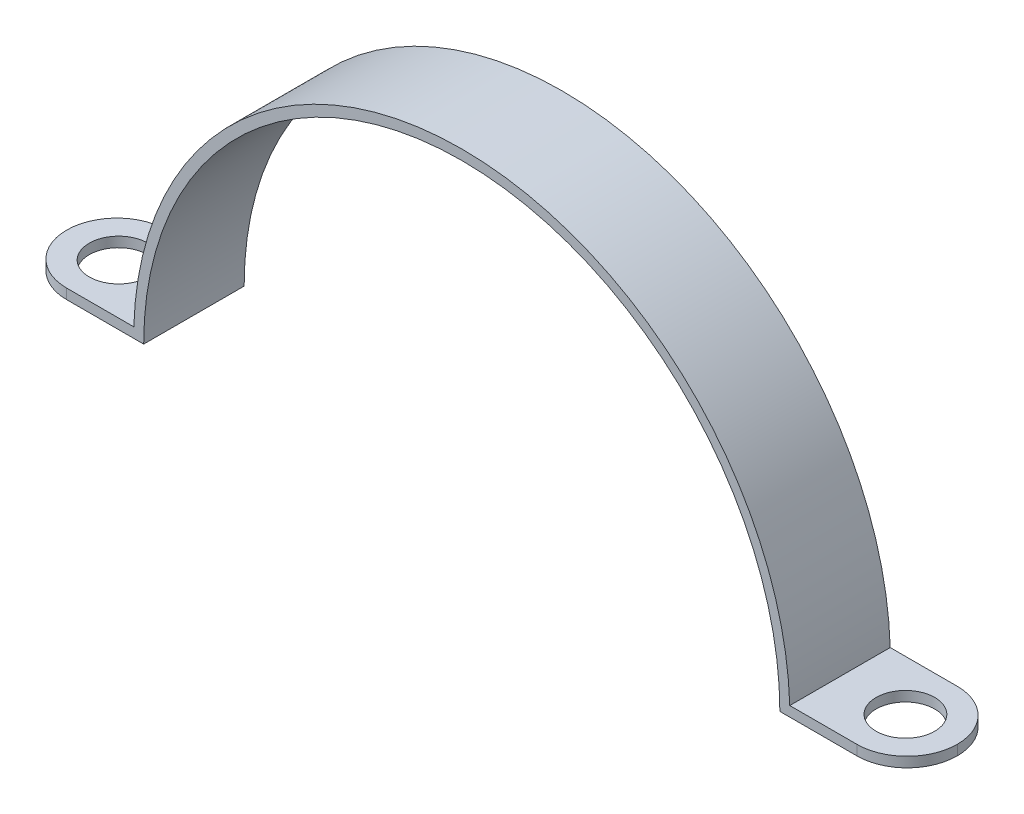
ISO-10303-21;
HEADER;
FILE_DESCRIPTION(('STEP AP214'),'2;1');
FILE_NAME('part.step','',(''),(''),'','','');
FILE_SCHEMA(('AUTOMOTIVE_DESIGN { 1 0 10303 214 1 1 1 1 }'));
ENDSEC;
DATA;
#1=APPLICATION_CONTEXT('core data for automotive mechanical design processes');
#2=APPLICATION_PROTOCOL_DEFINITION('international standard','automotive_design',2000,#1);
#3=PRODUCT_CONTEXT('',#1,'mechanical');
#4=PRODUCT('Part','Part','',(#3));
#5=PRODUCT_RELATED_PRODUCT_CATEGORY('part','',(#4));
#6=PRODUCT_DEFINITION_FORMATION('','',#4);
#7=PRODUCT_DEFINITION_CONTEXT('part definition',#1,'design');
#8=PRODUCT_DEFINITION('design','',#6,#7);
#9=PRODUCT_DEFINITION_SHAPE('','',#8);
#10=(LENGTH_UNIT() NAMED_UNIT(*) SI_UNIT(.MILLI.,.METRE.));
#11=(NAMED_UNIT(*) PLANE_ANGLE_UNIT() SI_UNIT($,.RADIAN.));
#12=(NAMED_UNIT(*) SI_UNIT($,.STERADIAN.) SOLID_ANGLE_UNIT());
#13=UNCERTAINTY_MEASURE_WITH_UNIT(LENGTH_MEASURE(1.E-05),#10,'distance_accuracy_value','');
#14=(GEOMETRIC_REPRESENTATION_CONTEXT(3) GLOBAL_UNCERTAINTY_ASSIGNED_CONTEXT((#13)) GLOBAL_UNIT_ASSIGNED_CONTEXT((#10,
#11,#12)) REPRESENTATION_CONTEXT('',''));
#15=CARTESIAN_POINT('',(0.,0.,0.));
#16=DIRECTION('',(0.,0.,1.));
#17=DIRECTION('',(1.,0.,0.));
#18=AXIS2_PLACEMENT_3D('',#15,#16,#17);
#19=CARTESIAN_POINT('',(19.,0.,3.));
#20=DIRECTION('',(0.,1.,0.));
#21=DIRECTION('',(0.,0.,1.));
#22=AXIS2_PLACEMENT_3D('',#19,#20,#21);
#23=PLANE('',#22);
#24=CARTESIAN_POINT('',(23.5,0.,0.));
#25=DIRECTION('',(0.,1.,0.));
#26=DIRECTION('',(-1.,0.,0.));
#27=AXIS2_PLACEMENT_3D('',#24,#25,#26);
#28=CIRCLE('',#27,1.75);
#29=CARTESIAN_POINT('',(21.75,0.,0.));
#30=VERTEX_POINT('',#29);
#31=EDGE_CURVE('E201',#30,#30,#28,.T.);
#32=ORIENTED_EDGE('',*,*,#31,.T.);
#33=EDGE_LOOP('',(#32));
#34=FACE_BOUND('',#33,.T.);
#35=DIRECTION('',(1.,0.,0.));
#36=VECTOR('',#35,1.);
#37=CARTESIAN_POINT('',(19.,0.,-3.));
#38=LINE('',#37,#36);
#39=CARTESIAN_POINT('',(19.,0.,-3.));
#40=VERTEX_POINT('',#39);
#41=CARTESIAN_POINT('',(23.6,0.,-3.));
#42=VERTEX_POINT('',#41);
#43=EDGE_CURVE('E149',#40,#42,#38,.T.);
#44=ORIENTED_EDGE('',*,*,#43,.T.);
#45=CARTESIAN_POINT('',(23.6,0.,0.));
#46=DIRECTION('',(0.,1.,0.));
#47=DIRECTION('',(0.,0.,1.));
#48=AXIS2_PLACEMENT_3D('',#45,#46,#47);
#49=CIRCLE('',#48,3.);
#50=CARTESIAN_POINT('',(26.6,0.,0.));
#51=VERTEX_POINT('',#50);
#52=EDGE_CURVE('E179',#42,#51,#49,.F.);
#53=ORIENTED_EDGE('',*,*,#52,.T.);
#54=CARTESIAN_POINT('',(23.6,0.,0.));
#55=DIRECTION('',(0.,1.,0.));
#56=DIRECTION('',(0.,0.,1.));
#57=AXIS2_PLACEMENT_3D('',#54,#55,#56);
#58=CIRCLE('',#57,3.);
#59=CARTESIAN_POINT('',(23.6,0.,3.));
#60=VERTEX_POINT('',#59);
#61=EDGE_CURVE('E177',#51,#60,#58,.F.);
#62=ORIENTED_EDGE('',*,*,#61,.T.);
#63=DIRECTION('',(1.,0.,0.));
#64=VECTOR('',#63,1.);
#65=CARTESIAN_POINT('',(19.,0.,3.));
#66=LINE('',#65,#64);
#67=CARTESIAN_POINT('',(19.,0.,3.));
#68=VERTEX_POINT('',#67);
#69=EDGE_CURVE('E124',#68,#60,#66,.T.);
#70=ORIENTED_EDGE('',*,*,#69,.F.);
#71=DIRECTION('',(0.,0.,-1.));
#72=VECTOR('',#71,1.);
#73=CARTESIAN_POINT('',(19.,0.,3.));
#74=LINE('',#73,#72);
#75=EDGE_CURVE('E148',#68,#40,#74,.T.);
#76=ORIENTED_EDGE('',*,*,#75,.T.);
#77=EDGE_LOOP('',(#44,#53,#62,#70,#76));
#78=FACE_BOUND('',#77,.T.);
#79=ADVANCED_FACE('F35',(#34,#78),#23,.F.);
#80=CARTESIAN_POINT('',(19.5908141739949,0.6,3.));
#81=DIRECTION('',(0.,-1.,0.));
#82=DIRECTION('',(1.,0.,0.));
#83=AXIS2_PLACEMENT_3D('',#80,#81,#82);
#84=PLANE('',#83);
#85=CARTESIAN_POINT('',(23.5,0.600000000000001,0.));
#86=DIRECTION('',(0.,1.,0.));
#87=DIRECTION('',(-1.,0.,0.));
#88=AXIS2_PLACEMENT_3D('',#85,#86,#87);
#89=CIRCLE('',#88,1.75);
#90=CARTESIAN_POINT('',(21.75,0.600000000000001,0.));
#91=VERTEX_POINT('',#90);
#92=EDGE_CURVE('E204',#91,#91,#89,.T.);
#93=ORIENTED_EDGE('',*,*,#92,.F.);
#94=EDGE_LOOP('',(#93));
#95=FACE_BOUND('',#94,.T.);
#96=CARTESIAN_POINT('',(23.6,0.6,0.));
#97=DIRECTION('',(0.,-1.,0.));
#98=DIRECTION('',(1.,0.,0.));
#99=AXIS2_PLACEMENT_3D('',#96,#97,#98);
#100=CIRCLE('',#99,3.);
#101=CARTESIAN_POINT('',(23.6,0.6,3.));
#102=VERTEX_POINT('',#101);
#103=CARTESIAN_POINT('',(26.6,0.6,0.));
#104=VERTEX_POINT('',#103);
#105=EDGE_CURVE('E133',#102,#104,#100,.F.);
#106=ORIENTED_EDGE('',*,*,#105,.T.);
#107=CARTESIAN_POINT('',(23.6,0.6,0.));
#108=DIRECTION('',(0.,-1.,0.));
#109=DIRECTION('',(1.,0.,0.));
#110=AXIS2_PLACEMENT_3D('',#107,#108,#109);
#111=CIRCLE('',#110,3.);
#112=CARTESIAN_POINT('',(23.6,0.6,-3.));
#113=VERTEX_POINT('',#112);
#114=EDGE_CURVE('E169',#104,#113,#111,.F.);
#115=ORIENTED_EDGE('',*,*,#114,.T.);
#116=DIRECTION('',(-1.,0.,0.));
#117=VECTOR('',#116,1.);
#118=CARTESIAN_POINT('',(19.5908141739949,0.6,-3.));
#119=LINE('',#118,#117);
#120=CARTESIAN_POINT('',(19.5908141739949,0.6,-3.));
#121=VERTEX_POINT('',#120);
#122=EDGE_CURVE('E130',#113,#121,#119,.T.);
#123=ORIENTED_EDGE('',*,*,#122,.T.);
#124=DIRECTION('',(0.,0.,-1.));
#125=VECTOR('',#124,1.);
#126=CARTESIAN_POINT('',(19.5908141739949,0.6,3.));
#127=LINE('',#126,#125);
#128=CARTESIAN_POINT('',(19.5908141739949,0.6,3.));
#129=VERTEX_POINT('',#128);
#130=EDGE_CURVE('E127',#129,#121,#127,.T.);
#131=ORIENTED_EDGE('',*,*,#130,.F.);
#132=DIRECTION('',(-1.,0.,0.));
#133=VECTOR('',#132,1.);
#134=CARTESIAN_POINT('',(19.5908141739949,0.6,3.));
#135=LINE('',#134,#133);
#136=EDGE_CURVE('E112',#102,#129,#135,.T.);
#137=ORIENTED_EDGE('',*,*,#136,.F.);
#138=EDGE_LOOP('',(#106,#115,#123,#131,#137));
#139=FACE_BOUND('',#138,.T.);
#140=ADVANCED_FACE('F128',(#95,#139),#84,.F.);
#141=CARTESIAN_POINT('',(0.,0.,3.));
#142=DIRECTION('',(0.,0.,-1.));
#143=DIRECTION('',(-1.,0.,0.));
#144=AXIS2_PLACEMENT_3D('',#141,#142,#143);
#145=CYLINDRICAL_SURFACE('',#144,19.6);
#146=CARTESIAN_POINT('',(0.,0.,-3.));
#147=DIRECTION('',(0.,0.,1.));
#148=DIRECTION('',(1.,0.,0.));
#149=AXIS2_PLACEMENT_3D('',#146,#147,#148);
#150=CIRCLE('',#149,19.6);
#151=CARTESIAN_POINT('',(-19.5908141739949,0.600000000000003,-3.));
#152=VERTEX_POINT('',#151);
#153=EDGE_CURVE('E154',#121,#152,#150,.T.);
#154=ORIENTED_EDGE('',*,*,#153,.T.);
#155=DIRECTION('',(0.,0.,-1.));
#156=VECTOR('',#155,1.);
#157=CARTESIAN_POINT('',(-19.5908141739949,0.600000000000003,3.));
#158=LINE('',#157,#156);
#159=CARTESIAN_POINT('',(-19.5908141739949,0.600000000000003,3.));
#160=VERTEX_POINT('',#159);
#161=EDGE_CURVE('E134',#160,#152,#158,.T.);
#162=ORIENTED_EDGE('',*,*,#161,.F.);
#163=CARTESIAN_POINT('',(0.,0.,3.));
#164=DIRECTION('',(0.,0.,1.));
#165=DIRECTION('',(1.,0.,0.));
#166=AXIS2_PLACEMENT_3D('',#163,#164,#165);
#167=CIRCLE('',#166,19.6);
#168=EDGE_CURVE('E118',#129,#160,#167,.T.);
#169=ORIENTED_EDGE('',*,*,#168,.F.);
#170=ORIENTED_EDGE('',*,*,#130,.T.);
#171=EDGE_LOOP('',(#154,#162,#169,#170));
#172=FACE_BOUND('',#171,.T.);
#173=ADVANCED_FACE('F136',(#172),#145,.T.);
#174=CARTESIAN_POINT('',(-26.6,0.6,3.));
#175=DIRECTION('',(0.,-1.,0.));
#176=DIRECTION('',(1.,0.,0.));
#177=AXIS2_PLACEMENT_3D('',#174,#175,#176);
#178=PLANE('',#177);
#179=CARTESIAN_POINT('',(-23.5,0.6,0.));
#180=DIRECTION('',(0.,1.,0.));
#181=DIRECTION('',(-1.,0.,0.));
#182=AXIS2_PLACEMENT_3D('',#179,#180,#181);
#183=CIRCLE('',#182,1.75);
#184=CARTESIAN_POINT('',(-25.25,0.6,0.));
#185=VERTEX_POINT('',#184);
#186=EDGE_CURVE('E196',#185,#185,#183,.T.);
#187=ORIENTED_EDGE('',*,*,#186,.F.);
#188=EDGE_LOOP('',(#187));
#189=FACE_BOUND('',#188,.T.);
#190=DIRECTION('',(-1.,0.,0.));
#191=VECTOR('',#190,1.);
#192=CARTESIAN_POINT('',(-26.6,0.6,-3.));
#193=LINE('',#192,#191);
#194=CARTESIAN_POINT('',(-23.6,0.6,-3.));
#195=VERTEX_POINT('',#194);
#196=EDGE_CURVE('E156',#152,#195,#193,.T.);
#197=ORIENTED_EDGE('',*,*,#196,.T.);
#198=CARTESIAN_POINT('',(-23.6,0.6,0.));
#199=DIRECTION('',(0.,-1.,0.));
#200=DIRECTION('',(1.,0.,0.));
#201=AXIS2_PLACEMENT_3D('',#198,#199,#200);
#202=CIRCLE('',#201,3.);
#203=CARTESIAN_POINT('',(-26.6,0.6,0.));
#204=VERTEX_POINT('',#203);
#205=EDGE_CURVE('E11',#195,#204,#202,.F.);
#206=ORIENTED_EDGE('',*,*,#205,.T.);
#207=CARTESIAN_POINT('',(-23.6,0.6,0.));
#208=DIRECTION('',(0.,-1.,0.));
#209=DIRECTION('',(1.,0.,0.));
#210=AXIS2_PLACEMENT_3D('',#207,#208,#209);
#211=CIRCLE('',#210,3.);
#212=CARTESIAN_POINT('',(-23.6,0.6,3.));
#213=VERTEX_POINT('',#212);
#214=EDGE_CURVE('E44',#204,#213,#211,.F.);
#215=ORIENTED_EDGE('',*,*,#214,.T.);
#216=DIRECTION('',(-1.,0.,0.));
#217=VECTOR('',#216,1.);
#218=CARTESIAN_POINT('',(-26.6,0.6,3.));
#219=LINE('',#218,#217);
#220=EDGE_CURVE('E139',#160,#213,#219,.T.);
#221=ORIENTED_EDGE('',*,*,#220,.F.);
#222=ORIENTED_EDGE('',*,*,#161,.T.);
#223=EDGE_LOOP('',(#197,#206,#215,#221,#222));
#224=FACE_BOUND('',#223,.T.);
#225=ADVANCED_FACE('F227',(#189,#224),#178,.F.);
#226=CARTESIAN_POINT('',(-26.6,0.,3.));
#227=DIRECTION('',(0.,1.,0.));
#228=DIRECTION('',(0.,0.,1.));
#229=AXIS2_PLACEMENT_3D('',#226,#227,#228);
#230=PLANE('',#229);
#231=CARTESIAN_POINT('',(-23.5,0.,0.));
#232=DIRECTION('',(0.,1.,0.));
#233=DIRECTION('',(-1.,0.,0.));
#234=AXIS2_PLACEMENT_3D('',#231,#232,#233);
#235=CIRCLE('',#234,1.75);
#236=CARTESIAN_POINT('',(-25.25,0.,0.));
#237=VERTEX_POINT('',#236);
#238=EDGE_CURVE('E192',#237,#237,#235,.T.);
#239=ORIENTED_EDGE('',*,*,#238,.T.);
#240=EDGE_LOOP('',(#239));
#241=FACE_BOUND('',#240,.T.);
#242=CARTESIAN_POINT('',(-23.6,0.,0.));
#243=DIRECTION('',(0.,1.,0.));
#244=DIRECTION('',(0.,0.,1.));
#245=AXIS2_PLACEMENT_3D('',#242,#243,#244);
#246=CIRCLE('',#245,3.);
#247=CARTESIAN_POINT('',(-23.6,0.,3.));
#248=VERTEX_POINT('',#247);
#249=CARTESIAN_POINT('',(-26.6,0.,0.));
#250=VERTEX_POINT('',#249);
#251=EDGE_CURVE('E58',#248,#250,#246,.F.);
#252=ORIENTED_EDGE('',*,*,#251,.T.);
#253=CARTESIAN_POINT('',(-23.6,0.,0.));
#254=DIRECTION('',(0.,1.,0.));
#255=DIRECTION('',(0.,0.,1.));
#256=AXIS2_PLACEMENT_3D('',#253,#254,#255);
#257=CIRCLE('',#256,3.);
#258=CARTESIAN_POINT('',(-23.6,0.,-3.));
#259=VERTEX_POINT('',#258);
#260=EDGE_CURVE('E185',#250,#259,#257,.F.);
#261=ORIENTED_EDGE('',*,*,#260,.T.);
#262=DIRECTION('',(1.,0.,0.));
#263=VECTOR('',#262,1.);
#264=CARTESIAN_POINT('',(-26.6,0.,-3.));
#265=LINE('',#264,#263);
#266=CARTESIAN_POINT('',(-19.,0.,-3.));
#267=VERTEX_POINT('',#266);
#268=EDGE_CURVE('E158',#259,#267,#265,.T.);
#269=ORIENTED_EDGE('',*,*,#268,.T.);
#270=DIRECTION('',(0.,0.,-1.));
#271=VECTOR('',#270,1.);
#272=CARTESIAN_POINT('',(-19.,0.,3.));
#273=LINE('',#272,#271);
#274=CARTESIAN_POINT('',(-19.,0.,3.));
#275=VERTEX_POINT('',#274);
#276=EDGE_CURVE('E164',#275,#267,#273,.T.);
#277=ORIENTED_EDGE('',*,*,#276,.F.);
#278=DIRECTION('',(1.,0.,0.));
#279=VECTOR('',#278,1.);
#280=CARTESIAN_POINT('',(-26.6,0.,3.));
#281=LINE('',#280,#279);
#282=EDGE_CURVE('E141',#248,#275,#281,.T.);
#283=ORIENTED_EDGE('',*,*,#282,.F.);
#284=EDGE_LOOP('',(#252,#261,#269,#277,#283));
#285=FACE_BOUND('',#284,.T.);
#286=ADVANCED_FACE('F225',(#241,#285),#230,.F.);
#287=CARTESIAN_POINT('',(0.,0.,3.));
#288=DIRECTION('',(0.,0.,-1.));
#289=DIRECTION('',(-1.,0.,0.));
#290=AXIS2_PLACEMENT_3D('',#287,#288,#289);
#291=CYLINDRICAL_SURFACE('',#290,19.);
#292=CARTESIAN_POINT('',(0.,0.,-3.));
#293=DIRECTION('',(0.,0.,-1.));
#294=DIRECTION('',(1.,0.,0.));
#295=AXIS2_PLACEMENT_3D('',#292,#293,#294);
#296=CIRCLE('',#295,19.);
#297=EDGE_CURVE('E160',#267,#40,#296,.T.);
#298=ORIENTED_EDGE('',*,*,#297,.T.);
#299=ORIENTED_EDGE('',*,*,#75,.F.);
#300=CARTESIAN_POINT('',(0.,0.,3.));
#301=DIRECTION('',(0.,0.,-1.));
#302=DIRECTION('',(1.,0.,0.));
#303=AXIS2_PLACEMENT_3D('',#300,#301,#302);
#304=CIRCLE('',#303,19.);
#305=EDGE_CURVE('E146',#275,#68,#304,.T.);
#306=ORIENTED_EDGE('',*,*,#305,.F.);
#307=ORIENTED_EDGE('',*,*,#276,.T.);
#308=EDGE_LOOP('',(#298,#299,#306,#307));
#309=FACE_BOUND('',#308,.T.);
#310=ADVANCED_FACE('F223',(#309),#291,.F.);
#311=CARTESIAN_POINT('',(0.,0.,3.));
#312=DIRECTION('',(0.,0.,1.));
#313=DIRECTION('',(1.,0.,0.));
#314=AXIS2_PLACEMENT_3D('',#311,#312,#313);
#315=PLANE('',#314);
#316=ORIENTED_EDGE('',*,*,#69,.T.);
#317=DIRECTION('',(0.,1.,0.));
#318=VECTOR('',#317,1.);
#319=CARTESIAN_POINT('',(23.6,0.6,3.));
#320=LINE('',#319,#318);
#321=EDGE_CURVE('E121',#60,#102,#320,.T.);
#322=ORIENTED_EDGE('',*,*,#321,.T.);
#323=ORIENTED_EDGE('',*,*,#136,.T.);
#324=ORIENTED_EDGE('',*,*,#168,.T.);
#325=ORIENTED_EDGE('',*,*,#220,.T.);
#326=DIRECTION('',(0.,-1.,0.));
#327=VECTOR('',#326,1.);
#328=CARTESIAN_POINT('',(-23.6,0.,3.));
#329=LINE('',#328,#327);
#330=EDGE_CURVE('E181',#213,#248,#329,.T.);
#331=ORIENTED_EDGE('',*,*,#330,.T.);
#332=ORIENTED_EDGE('',*,*,#282,.T.);
#333=ORIENTED_EDGE('',*,*,#305,.T.);
#334=EDGE_LOOP('',(#316,#322,#323,#324,#325,#331,#332,#333));
#335=FACE_BOUND('',#334,.T.);
#336=ADVANCED_FACE('F115',(#335),#315,.T.);
#337=CARTESIAN_POINT('',(0.,0.,-3.));
#338=DIRECTION('',(0.,0.,1.));
#339=DIRECTION('',(1.,0.,0.));
#340=AXIS2_PLACEMENT_3D('',#337,#338,#339);
#341=PLANE('',#340);
#342=ORIENTED_EDGE('',*,*,#122,.F.);
#343=DIRECTION('',(0.,1.,0.));
#344=VECTOR('',#343,1.);
#345=CARTESIAN_POINT('',(23.6,0.,-3.));
#346=LINE('',#345,#344);
#347=EDGE_CURVE('E174',#113,#42,#346,.F.);
#348=ORIENTED_EDGE('',*,*,#347,.T.);
#349=ORIENTED_EDGE('',*,*,#43,.F.);
#350=ORIENTED_EDGE('',*,*,#297,.F.);
#351=ORIENTED_EDGE('',*,*,#268,.F.);
#352=DIRECTION('',(0.,-1.,0.));
#353=VECTOR('',#352,1.);
#354=CARTESIAN_POINT('',(-23.6,0.,-3.));
#355=LINE('',#354,#353);
#356=EDGE_CURVE('E171',#259,#195,#355,.F.);
#357=ORIENTED_EDGE('',*,*,#356,.T.);
#358=ORIENTED_EDGE('',*,*,#196,.F.);
#359=ORIENTED_EDGE('',*,*,#153,.F.);
#360=EDGE_LOOP('',(#342,#348,#349,#350,#351,#357,#358,#359));
#361=FACE_BOUND('',#360,.T.);
#362=ADVANCED_FACE('F215',(#361),#341,.F.);
#363=CARTESIAN_POINT('',(23.6,0.,0.));
#364=DIRECTION('',(0.,-1.,0.));
#365=DIRECTION('',(0.,0.,-1.));
#366=AXIS2_PLACEMENT_3D('',#363,#364,#365);
#367=CYLINDRICAL_SURFACE('',#366,3.);
#368=ORIENTED_EDGE('',*,*,#321,.F.);
#369=ORIENTED_EDGE('',*,*,#61,.F.);
#370=DIRECTION('',(0.,1.,0.));
#371=VECTOR('',#370,1.);
#372=CARTESIAN_POINT('',(26.6,0.,0.));
#373=LINE('',#372,#371);
#374=EDGE_CURVE('E152',#104,#51,#373,.F.);
#375=ORIENTED_EDGE('',*,*,#374,.F.);
#376=ORIENTED_EDGE('',*,*,#105,.F.);
#377=EDGE_LOOP('',(#368,#369,#375,#376));
#378=FACE_BOUND('',#377,.T.);
#379=ADVANCED_FACE('F212',(#378),#367,.T.);
#380=CARTESIAN_POINT('',(23.6,0.6,0.));
#381=DIRECTION('',(0.,1.,0.));
#382=DIRECTION('',(0.,0.,1.));
#383=AXIS2_PLACEMENT_3D('',#380,#381,#382);
#384=CYLINDRICAL_SURFACE('',#383,3.);
#385=ORIENTED_EDGE('',*,*,#52,.F.);
#386=ORIENTED_EDGE('',*,*,#347,.F.);
#387=ORIENTED_EDGE('',*,*,#114,.F.);
#388=ORIENTED_EDGE('',*,*,#374,.T.);
#389=EDGE_LOOP('',(#385,#386,#387,#388));
#390=FACE_BOUND('',#389,.T.);
#391=ADVANCED_FACE('F218',(#390),#384,.T.);
#392=CARTESIAN_POINT('',(-23.6,0.,0.));
#393=DIRECTION('',(0.,1.,0.));
#394=DIRECTION('',(0.,0.,1.));
#395=AXIS2_PLACEMENT_3D('',#392,#393,#394);
#396=CYLINDRICAL_SURFACE('',#395,3.);
#397=ORIENTED_EDGE('',*,*,#330,.F.);
#398=ORIENTED_EDGE('',*,*,#214,.F.);
#399=DIRECTION('',(0.,-1.,0.));
#400=VECTOR('',#399,1.);
#401=CARTESIAN_POINT('',(-26.6,0.6,0.));
#402=LINE('',#401,#400);
#403=EDGE_CURVE('E39',#250,#204,#402,.F.);
#404=ORIENTED_EDGE('',*,*,#403,.F.);
#405=ORIENTED_EDGE('',*,*,#251,.F.);
#406=EDGE_LOOP('',(#397,#398,#404,#405));
#407=FACE_BOUND('',#406,.T.);
#408=ADVANCED_FACE('F37',(#407),#396,.T.);
#409=CARTESIAN_POINT('',(-23.6,0.6,0.));
#410=DIRECTION('',(0.,-1.,0.));
#411=DIRECTION('',(0.,0.,-1.));
#412=AXIS2_PLACEMENT_3D('',#409,#410,#411);
#413=CYLINDRICAL_SURFACE('',#412,3.);
#414=ORIENTED_EDGE('',*,*,#205,.F.);
#415=ORIENTED_EDGE('',*,*,#356,.F.);
#416=ORIENTED_EDGE('',*,*,#260,.F.);
#417=ORIENTED_EDGE('',*,*,#403,.T.);
#418=EDGE_LOOP('',(#414,#415,#416,#417));
#419=FACE_BOUND('',#418,.T.);
#420=ADVANCED_FACE('F226',(#419),#413,.T.);
#421=CARTESIAN_POINT('',(-23.5,0.,0.));
#422=DIRECTION('',(0.,1.,0.));
#423=DIRECTION('',(-1.,0.,0.));
#424=AXIS2_PLACEMENT_3D('',#421,#422,#423);
#425=CYLINDRICAL_SURFACE('',#424,1.75);
#426=ORIENTED_EDGE('',*,*,#238,.F.);
#427=EDGE_LOOP('',(#426));
#428=FACE_BOUND('',#427,.T.);
#429=ORIENTED_EDGE('',*,*,#186,.T.);
#430=EDGE_LOOP('',(#429));
#431=FACE_BOUND('',#430,.T.);
#432=ADVANCED_FACE('F235',(#428,#431),#425,.F.);
#433=CARTESIAN_POINT('',(23.5,0.,0.));
#434=DIRECTION('',(0.,1.,0.));
#435=DIRECTION('',(-1.,0.,0.));
#436=AXIS2_PLACEMENT_3D('',#433,#434,#435);
#437=CYLINDRICAL_SURFACE('',#436,1.75);
#438=ORIENTED_EDGE('',*,*,#31,.F.);
#439=EDGE_LOOP('',(#438));
#440=FACE_BOUND('',#439,.T.);
#441=ORIENTED_EDGE('',*,*,#92,.T.);
#442=EDGE_LOOP('',(#441));
#443=FACE_BOUND('',#442,.T.);
#444=ADVANCED_FACE('F335',(#440,#443),#437,.F.);
#445=CLOSED_SHELL('',(#79,#140,#173,#225,#286,#310,#336,#362,#379,#391,#408,#420,#432,#444));
#446=MANIFOLD_SOLID_BREP('B2',#445);
#447=ADVANCED_BREP_SHAPE_REPRESENTATION('',(#18,#446),#14);
#448=SHAPE_DEFINITION_REPRESENTATION(#9,#447);
ENDSEC;
END-ISO-10303-21;
